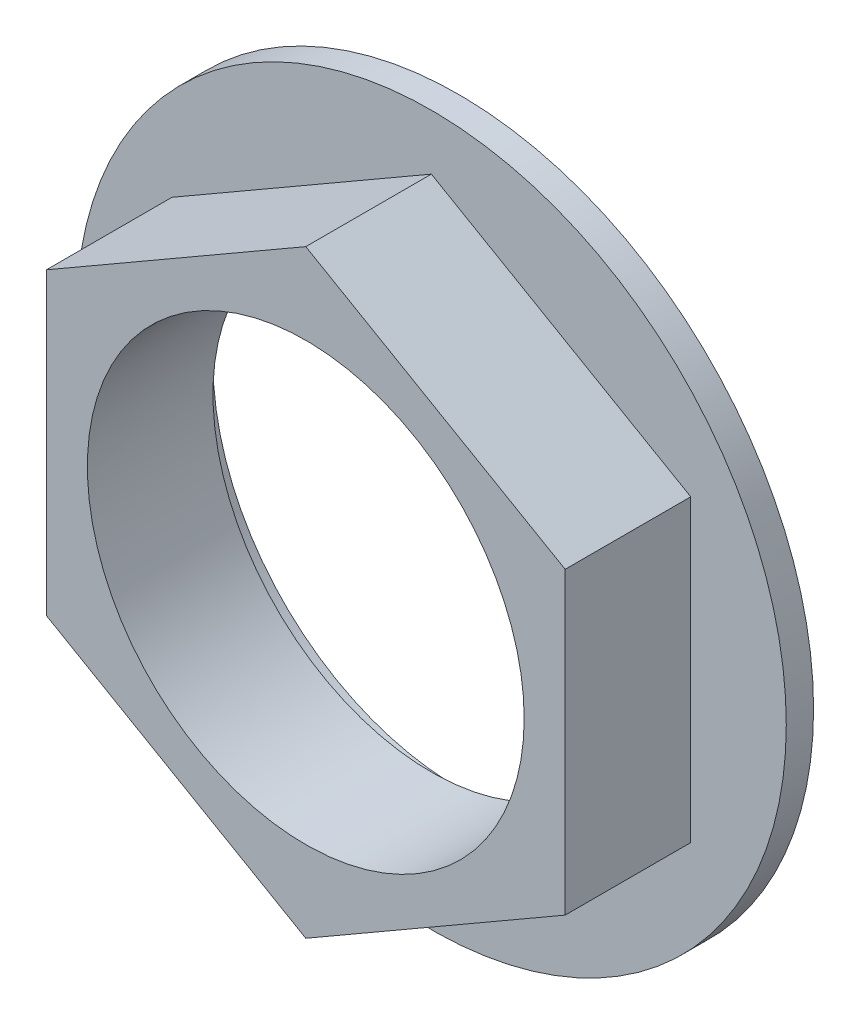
ISO-10303-21;
HEADER;
FILE_DESCRIPTION(('STEP AP214'),'2;1');
FILE_NAME('part.step','',(''),(''),'','','');
FILE_SCHEMA(('AUTOMOTIVE_DESIGN { 1 0 10303 214 1 1 1 1 }'));
ENDSEC;
DATA;
#1=APPLICATION_CONTEXT('core data for automotive mechanical design processes');
#2=APPLICATION_PROTOCOL_DEFINITION('international standard','automotive_design',2000,#1);
#3=PRODUCT_CONTEXT('',#1,'mechanical');
#4=PRODUCT('Part','Part','',(#3));
#5=PRODUCT_RELATED_PRODUCT_CATEGORY('part','',(#4));
#6=PRODUCT_DEFINITION_FORMATION('','',#4);
#7=PRODUCT_DEFINITION_CONTEXT('part definition',#1,'design');
#8=PRODUCT_DEFINITION('design','',#6,#7);
#9=PRODUCT_DEFINITION_SHAPE('','',#8);
#10=(LENGTH_UNIT() NAMED_UNIT(*) SI_UNIT(.MILLI.,.METRE.));
#11=(NAMED_UNIT(*) PLANE_ANGLE_UNIT() SI_UNIT($,.RADIAN.));
#12=(NAMED_UNIT(*) SI_UNIT($,.STERADIAN.) SOLID_ANGLE_UNIT());
#13=UNCERTAINTY_MEASURE_WITH_UNIT(LENGTH_MEASURE(1.E-05),#10,'distance_accuracy_value','');
#14=(GEOMETRIC_REPRESENTATION_CONTEXT(3) GLOBAL_UNCERTAINTY_ASSIGNED_CONTEXT((#13)) GLOBAL_UNIT_ASSIGNED_CONTEXT((#10,
#11,#12)) REPRESENTATION_CONTEXT('',''));
#15=CARTESIAN_POINT('',(0.,0.,0.));
#16=DIRECTION('',(0.,0.,1.));
#17=DIRECTION('',(1.,0.,0.));
#18=AXIS2_PLACEMENT_3D('',#15,#16,#17);
#19=CARTESIAN_POINT('',(0.,13.,1.));
#20=DIRECTION('',(0.,0.,-1.));
#21=DIRECTION('',(-1.,0.,0.));
#22=AXIS2_PLACEMENT_3D('',#19,#20,#21);
#23=PLANE('',#22);
#24=CARTESIAN_POINT('',(0.,0.,1.));
#25=DIRECTION('',(0.,0.,1.));
#26=DIRECTION('',(1.,0.,0.));
#27=AXIS2_PLACEMENT_3D('',#24,#25,#26);
#28=CIRCLE('',#27,13.);
#29=CARTESIAN_POINT('',(13.,0.,1.));
#30=VERTEX_POINT('',#29);
#31=EDGE_CURVE('E119',#30,#30,#28,.T.);
#32=ORIENTED_EDGE('',*,*,#31,.T.);
#33=EDGE_LOOP('',(#32));
#34=FACE_BOUND('',#33,.T.);
#35=DIRECTION('',(0.,-1.,0.));
#36=VECTOR('',#35,1.);
#37=CARTESIAN_POINT('',(-9.5001716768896,5.484926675,1.));
#38=LINE('',#37,#36);
#39=CARTESIAN_POINT('',(-9.5001716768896,5.484926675,1.));
#40=VERTEX_POINT('',#39);
#41=CARTESIAN_POINT('',(-9.5001716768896,-5.48492667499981,1.));
#42=VERTEX_POINT('',#41);
#43=EDGE_CURVE('E29',#40,#42,#38,.T.);
#44=ORIENTED_EDGE('',*,*,#43,.F.);
#45=DIRECTION('',(-0.866025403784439,-0.5,0.));
#46=VECTOR('',#45,1.);
#47=CARTESIAN_POINT('',(0.,10.9698533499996,1.));
#48=LINE('',#47,#46);
#49=CARTESIAN_POINT('',(0.,10.9698533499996,1.));
#50=VERTEX_POINT('',#49);
#51=EDGE_CURVE('E34',#50,#40,#48,.T.);
#52=ORIENTED_EDGE('',*,*,#51,.F.);
#53=DIRECTION('',(0.866025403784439,-0.5,0.));
#54=VECTOR('',#53,1.);
#55=CARTESIAN_POINT('',(0.,10.9698533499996,1.));
#56=LINE('',#55,#54);
#57=CARTESIAN_POINT('',(9.5001716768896,5.484926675,1.));
#58=VERTEX_POINT('',#57);
#59=EDGE_CURVE('E92',#50,#58,#56,.T.);
#60=ORIENTED_EDGE('',*,*,#59,.T.);
#61=DIRECTION('',(0.,-1.,0.));
#62=VECTOR('',#61,1.);
#63=CARTESIAN_POINT('',(9.5001716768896,5.484926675,1.));
#64=LINE('',#63,#62);
#65=CARTESIAN_POINT('',(9.5001716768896,-5.48492667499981,1.));
#66=VERTEX_POINT('',#65);
#67=EDGE_CURVE('E70',#58,#66,#64,.T.);
#68=ORIENTED_EDGE('',*,*,#67,.T.);
#69=DIRECTION('',(-0.866025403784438,-0.5,0.));
#70=VECTOR('',#69,1.);
#71=CARTESIAN_POINT('',(9.5001716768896,-5.48492667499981,1.));
#72=LINE('',#71,#70);
#73=CARTESIAN_POINT('',(0.,-10.9698533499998,1.));
#74=VERTEX_POINT('',#73);
#75=EDGE_CURVE('E64',#66,#74,#72,.T.);
#76=ORIENTED_EDGE('',*,*,#75,.T.);
#77=DIRECTION('',(0.866025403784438,-0.5,0.));
#78=VECTOR('',#77,1.);
#79=CARTESIAN_POINT('',(-9.5001716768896,-5.48492667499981,1.));
#80=LINE('',#79,#78);
#81=EDGE_CURVE('E67',#42,#74,#80,.T.);
#82=ORIENTED_EDGE('',*,*,#81,.F.);
#83=EDGE_LOOP('',(#44,#52,#60,#68,#76,#82));
#84=FACE_BOUND('',#83,.T.);
#85=ADVANCED_FACE('F14',(#34,#84),#23,.F.);
#86=CARTESIAN_POINT('',(0.,0.,15.5));
#87=DIRECTION('',(0.,0.,1.));
#88=DIRECTION('',(1.,0.,0.));
#89=AXIS2_PLACEMENT_3D('',#86,#87,#88);
#90=CYLINDRICAL_SURFACE('',#89,9.);
#91=CARTESIAN_POINT('',(0.,0.,0.));
#92=DIRECTION('',(0.,0.,1.));
#93=DIRECTION('',(1.,0.,0.));
#94=AXIS2_PLACEMENT_3D('',#91,#92,#93);
#95=CIRCLE('',#94,9.);
#96=CARTESIAN_POINT('',(9.,0.,0.));
#97=VERTEX_POINT('',#96);
#98=EDGE_CURVE('E9',#97,#97,#95,.T.);
#99=ORIENTED_EDGE('',*,*,#98,.F.);
#100=EDGE_LOOP('',(#99));
#101=FACE_BOUND('',#100,.T.);
#102=CARTESIAN_POINT('',(0.,0.,1.));
#103=DIRECTION('',(0.,0.,1.));
#104=DIRECTION('',(1.,0.,0.));
#105=AXIS2_PLACEMENT_3D('',#102,#103,#104);
#106=CIRCLE('',#105,9.);
#107=CARTESIAN_POINT('',(9.,0.,1.));
#108=VERTEX_POINT('',#107);
#109=EDGE_CURVE('E17',#108,#108,#106,.T.);
#110=ORIENTED_EDGE('',*,*,#109,.T.);
#111=EDGE_LOOP('',(#110));
#112=FACE_BOUND('',#111,.T.);
#113=ADVANCED_FACE('F130',(#101,#112),#90,.F.);
#114=CARTESIAN_POINT('',(0.,13.,0.));
#115=DIRECTION('',(0.,0.,-1.));
#116=DIRECTION('',(-1.,0.,0.));
#117=AXIS2_PLACEMENT_3D('',#114,#115,#116);
#118=PLANE('',#117);
#119=ORIENTED_EDGE('',*,*,#98,.T.);
#120=EDGE_LOOP('',(#119));
#121=FACE_BOUND('',#120,.T.);
#122=CARTESIAN_POINT('',(0.,0.,0.));
#123=DIRECTION('',(0.,0.,1.));
#124=DIRECTION('',(1.,0.,0.));
#125=AXIS2_PLACEMENT_3D('',#122,#123,#124);
#126=CIRCLE('',#125,13.);
#127=CARTESIAN_POINT('',(13.,0.,0.));
#128=VERTEX_POINT('',#127);
#129=EDGE_CURVE('E22',#128,#128,#126,.T.);
#130=ORIENTED_EDGE('',*,*,#129,.F.);
#131=EDGE_LOOP('',(#130));
#132=FACE_BOUND('',#131,.T.);
#133=ADVANCED_FACE('F128',(#121,#132),#118,.T.);
#134=CARTESIAN_POINT('',(0.,0.,15.5));
#135=DIRECTION('',(0.,0.,1.));
#136=DIRECTION('',(1.,0.,0.));
#137=AXIS2_PLACEMENT_3D('',#134,#135,#136);
#138=CYLINDRICAL_SURFACE('',#137,13.);
#139=ORIENTED_EDGE('',*,*,#129,.T.);
#140=EDGE_LOOP('',(#139));
#141=FACE_BOUND('',#140,.T.);
#142=ORIENTED_EDGE('',*,*,#31,.F.);
#143=EDGE_LOOP('',(#142));
#144=FACE_BOUND('',#143,.T.);
#145=ADVANCED_FACE('F125',(#141,#144),#138,.T.);
#146=CARTESIAN_POINT('',(-9.50017167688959,16.4547800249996,5.6));
#147=DIRECTION('',(0.,0.,1.));
#148=DIRECTION('',(1.,0.,0.));
#149=AXIS2_PLACEMENT_3D('',#146,#147,#148);
#150=PLANE('',#149);
#151=CARTESIAN_POINT('',(0.,0.,5.6));
#152=DIRECTION('',(0.,0.,1.));
#153=DIRECTION('',(1.,0.,0.));
#154=AXIS2_PLACEMENT_3D('',#151,#152,#153);
#155=CIRCLE('',#154,8.);
#156=CARTESIAN_POINT('',(8.,0.,5.6));
#157=VERTEX_POINT('',#156);
#158=EDGE_CURVE('E262',#157,#157,#155,.T.);
#159=ORIENTED_EDGE('',*,*,#158,.F.);
#160=EDGE_LOOP('',(#159));
#161=FACE_BOUND('',#160,.T.);
#162=DIRECTION('',(0.,-1.,0.));
#163=VECTOR('',#162,1.);
#164=CARTESIAN_POINT('',(-9.5001716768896,5.484926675,5.6));
#165=LINE('',#164,#163);
#166=CARTESIAN_POINT('',(-9.5001716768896,5.484926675,5.6));
#167=VERTEX_POINT('',#166);
#168=CARTESIAN_POINT('',(-9.5001716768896,-5.48492667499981,5.6));
#169=VERTEX_POINT('',#168);
#170=EDGE_CURVE('E95',#167,#169,#165,.T.);
#171=ORIENTED_EDGE('',*,*,#170,.T.);
#172=DIRECTION('',(0.866025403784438,-0.5,0.));
#173=VECTOR('',#172,1.);
#174=CARTESIAN_POINT('',(-9.5001716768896,-5.48492667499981,5.6));
#175=LINE('',#174,#173);
#176=CARTESIAN_POINT('',(0.,-10.9698533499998,5.6));
#177=VERTEX_POINT('',#176);
#178=EDGE_CURVE('E98',#169,#177,#175,.T.);
#179=ORIENTED_EDGE('',*,*,#178,.T.);
#180=DIRECTION('',(-0.866025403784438,-0.5,0.));
#181=VECTOR('',#180,1.);
#182=CARTESIAN_POINT('',(9.5001716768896,-5.48492667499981,5.6));
#183=LINE('',#182,#181);
#184=CARTESIAN_POINT('',(9.5001716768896,-5.48492667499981,5.6));
#185=VERTEX_POINT('',#184);
#186=EDGE_CURVE('E78',#185,#177,#183,.T.);
#187=ORIENTED_EDGE('',*,*,#186,.F.);
#188=DIRECTION('',(0.,-1.,0.));
#189=VECTOR('',#188,1.);
#190=CARTESIAN_POINT('',(9.5001716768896,5.484926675,5.6));
#191=LINE('',#190,#189);
#192=CARTESIAN_POINT('',(9.5001716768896,5.484926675,5.6));
#193=VERTEX_POINT('',#192);
#194=EDGE_CURVE('E101',#193,#185,#191,.T.);
#195=ORIENTED_EDGE('',*,*,#194,.F.);
#196=DIRECTION('',(0.866025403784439,-0.5,0.));
#197=VECTOR('',#196,1.);
#198=CARTESIAN_POINT('',(0.,10.9698533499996,5.6));
#199=LINE('',#198,#197);
#200=CARTESIAN_POINT('',(0.,10.9698533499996,5.6));
#201=VERTEX_POINT('',#200);
#202=EDGE_CURVE('E104',#201,#193,#199,.T.);
#203=ORIENTED_EDGE('',*,*,#202,.F.);
#204=DIRECTION('',(-0.866025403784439,-0.5,0.));
#205=VECTOR('',#204,1.);
#206=CARTESIAN_POINT('',(0.,10.9698533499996,5.6));
#207=LINE('',#206,#205);
#208=EDGE_CURVE('E107',#201,#167,#207,.T.);
#209=ORIENTED_EDGE('',*,*,#208,.T.);
#210=EDGE_LOOP('',(#171,#179,#187,#195,#203,#209));
#211=FACE_BOUND('',#210,.T.);
#212=ADVANCED_FACE('F139',(#161,#211),#150,.T.);
#213=CARTESIAN_POINT('',(0.,10.9698533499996,5.6));
#214=DIRECTION('',(0.5,-0.866025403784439,0.));
#215=DIRECTION('',(-0.866025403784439,-0.5,0.));
#216=AXIS2_PLACEMENT_3D('',#213,#214,#215);
#217=PLANE('',#216);
#218=ORIENTED_EDGE('',*,*,#208,.F.);
#219=DIRECTION('',(0.,0.,-1.));
#220=VECTOR('',#219,1.);
#221=CARTESIAN_POINT('',(0.,10.9698533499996,5.6));
#222=LINE('',#221,#220);
#223=EDGE_CURVE('E112',#201,#50,#222,.T.);
#224=ORIENTED_EDGE('',*,*,#223,.T.);
#225=ORIENTED_EDGE('',*,*,#51,.T.);
#226=DIRECTION('',(0.,0.,-1.));
#227=VECTOR('',#226,1.);
#228=CARTESIAN_POINT('',(-9.5001716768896,5.484926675,5.6));
#229=LINE('',#228,#227);
#230=EDGE_CURVE('E110',#167,#40,#229,.T.);
#231=ORIENTED_EDGE('',*,*,#230,.F.);
#232=EDGE_LOOP('',(#218,#224,#225,#231));
#233=FACE_BOUND('',#232,.T.);
#234=ADVANCED_FACE('F178',(#233),#217,.F.);
#235=CARTESIAN_POINT('',(0.,10.9698533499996,5.6));
#236=DIRECTION('',(0.5,0.866025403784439,0.));
#237=DIRECTION('',(0.866025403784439,-0.5,0.));
#238=AXIS2_PLACEMENT_3D('',#235,#236,#237);
#239=PLANE('',#238);
#240=ORIENTED_EDGE('',*,*,#223,.F.);
#241=ORIENTED_EDGE('',*,*,#202,.T.);
#242=DIRECTION('',(0.,0.,-1.));
#243=VECTOR('',#242,1.);
#244=CARTESIAN_POINT('',(9.5001716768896,5.484926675,5.6));
#245=LINE('',#244,#243);
#246=EDGE_CURVE('E114',#193,#58,#245,.T.);
#247=ORIENTED_EDGE('',*,*,#246,.T.);
#248=ORIENTED_EDGE('',*,*,#59,.F.);
#249=EDGE_LOOP('',(#240,#241,#247,#248));
#250=FACE_BOUND('',#249,.T.);
#251=ADVANCED_FACE('F186',(#250),#239,.T.);
#252=CARTESIAN_POINT('',(9.5001716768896,5.484926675,5.6));
#253=DIRECTION('',(1.,0.,0.));
#254=DIRECTION('',(0.,0.,-1.));
#255=AXIS2_PLACEMENT_3D('',#252,#253,#254);
#256=PLANE('',#255);
#257=ORIENTED_EDGE('',*,*,#246,.F.);
#258=ORIENTED_EDGE('',*,*,#194,.T.);
#259=DIRECTION('',(0.,0.,-1.));
#260=VECTOR('',#259,1.);
#261=CARTESIAN_POINT('',(9.5001716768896,-5.48492667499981,5.6));
#262=LINE('',#261,#260);
#263=EDGE_CURVE('E83',#185,#66,#262,.T.);
#264=ORIENTED_EDGE('',*,*,#263,.T.);
#265=ORIENTED_EDGE('',*,*,#67,.F.);
#266=EDGE_LOOP('',(#257,#258,#264,#265));
#267=FACE_BOUND('',#266,.T.);
#268=ADVANCED_FACE('F195',(#267),#256,.T.);
#269=CARTESIAN_POINT('',(9.5001716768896,-5.48492667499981,5.6));
#270=DIRECTION('',(0.5,-0.866025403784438,0.));
#271=DIRECTION('',(-0.866025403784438,-0.5,0.));
#272=AXIS2_PLACEMENT_3D('',#269,#270,#271);
#273=PLANE('',#272);
#274=ORIENTED_EDGE('',*,*,#263,.F.);
#275=ORIENTED_EDGE('',*,*,#186,.T.);
#276=DIRECTION('',(0.,0.,-1.));
#277=VECTOR('',#276,1.);
#278=CARTESIAN_POINT('',(0.,-10.9698533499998,5.6));
#279=LINE('',#278,#277);
#280=EDGE_CURVE('E75',#177,#74,#279,.T.);
#281=ORIENTED_EDGE('',*,*,#280,.T.);
#282=ORIENTED_EDGE('',*,*,#75,.F.);
#283=EDGE_LOOP('',(#274,#275,#281,#282));
#284=FACE_BOUND('',#283,.T.);
#285=ADVANCED_FACE('F76',(#284),#273,.T.);
#286=CARTESIAN_POINT('',(-9.5001716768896,-5.48492667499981,5.6));
#287=DIRECTION('',(0.5,0.866025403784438,0.));
#288=DIRECTION('',(0.866025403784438,-0.5,0.));
#289=AXIS2_PLACEMENT_3D('',#286,#287,#288);
#290=PLANE('',#289);
#291=ORIENTED_EDGE('',*,*,#280,.F.);
#292=ORIENTED_EDGE('',*,*,#178,.F.);
#293=DIRECTION('',(0.,0.,-1.));
#294=VECTOR('',#293,1.);
#295=CARTESIAN_POINT('',(-9.5001716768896,-5.48492667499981,5.6));
#296=LINE('',#295,#294);
#297=EDGE_CURVE('E82',#169,#42,#296,.T.);
#298=ORIENTED_EDGE('',*,*,#297,.T.);
#299=ORIENTED_EDGE('',*,*,#81,.T.);
#300=EDGE_LOOP('',(#291,#292,#298,#299));
#301=FACE_BOUND('',#300,.T.);
#302=ADVANCED_FACE('F85',(#301),#290,.F.);
#303=CARTESIAN_POINT('',(-9.5001716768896,5.484926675,5.6));
#304=DIRECTION('',(1.,0.,0.));
#305=DIRECTION('',(0.,0.,-1.));
#306=AXIS2_PLACEMENT_3D('',#303,#304,#305);
#307=PLANE('',#306);
#308=ORIENTED_EDGE('',*,*,#297,.F.);
#309=ORIENTED_EDGE('',*,*,#170,.F.);
#310=ORIENTED_EDGE('',*,*,#230,.T.);
#311=ORIENTED_EDGE('',*,*,#43,.T.);
#312=EDGE_LOOP('',(#308,#309,#310,#311));
#313=FACE_BOUND('',#312,.T.);
#314=ADVANCED_FACE('F219',(#313),#307,.F.);
#315=CARTESIAN_POINT('',(-9.50017167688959,16.4547800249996,1.));
#316=DIRECTION('',(0.,0.,1.));
#317=DIRECTION('',(1.,0.,0.));
#318=AXIS2_PLACEMENT_3D('',#315,#316,#317);
#319=PLANE('',#318);
#320=CARTESIAN_POINT('',(0.,0.,1.));
#321=DIRECTION('',(0.,0.,1.));
#322=DIRECTION('',(1.,0.,0.));
#323=AXIS2_PLACEMENT_3D('',#320,#321,#322);
#324=CIRCLE('',#323,8.);
#325=CARTESIAN_POINT('',(8.,0.,1.));
#326=VERTEX_POINT('',#325);
#327=EDGE_CURVE('E87',#326,#326,#324,.T.);
#328=ORIENTED_EDGE('',*,*,#327,.T.);
#329=EDGE_LOOP('',(#328));
#330=FACE_BOUND('',#329,.T.);
#331=ORIENTED_EDGE('',*,*,#109,.F.);
#332=EDGE_LOOP('',(#331));
#333=FACE_BOUND('',#332,.T.);
#334=ADVANCED_FACE('F227',(#330,#333),#319,.F.);
#335=CARTESIAN_POINT('',(0.,0.,1.));
#336=DIRECTION('',(0.,0.,1.));
#337=DIRECTION('',(1.,0.,0.));
#338=AXIS2_PLACEMENT_3D('',#335,#336,#337);
#339=CYLINDRICAL_SURFACE('',#338,8.);
#340=ORIENTED_EDGE('',*,*,#327,.F.);
#341=EDGE_LOOP('',(#340));
#342=FACE_BOUND('',#341,.T.);
#343=ORIENTED_EDGE('',*,*,#158,.T.);
#344=EDGE_LOOP('',(#343));
#345=FACE_BOUND('',#344,.T.);
#346=ADVANCED_FACE('F236',(#342,#345),#339,.F.);
#347=CLOSED_SHELL('',(#85,#113,#133,#145,#212,#234,#251,#268,#285,#302,#314,#334,#346));
#348=MANIFOLD_SOLID_BREP('B1',#347);
#349=ADVANCED_BREP_SHAPE_REPRESENTATION('',(#18,#348),#14);
#350=SHAPE_DEFINITION_REPRESENTATION(#9,#349);
ENDSEC;
END-ISO-10303-21;
